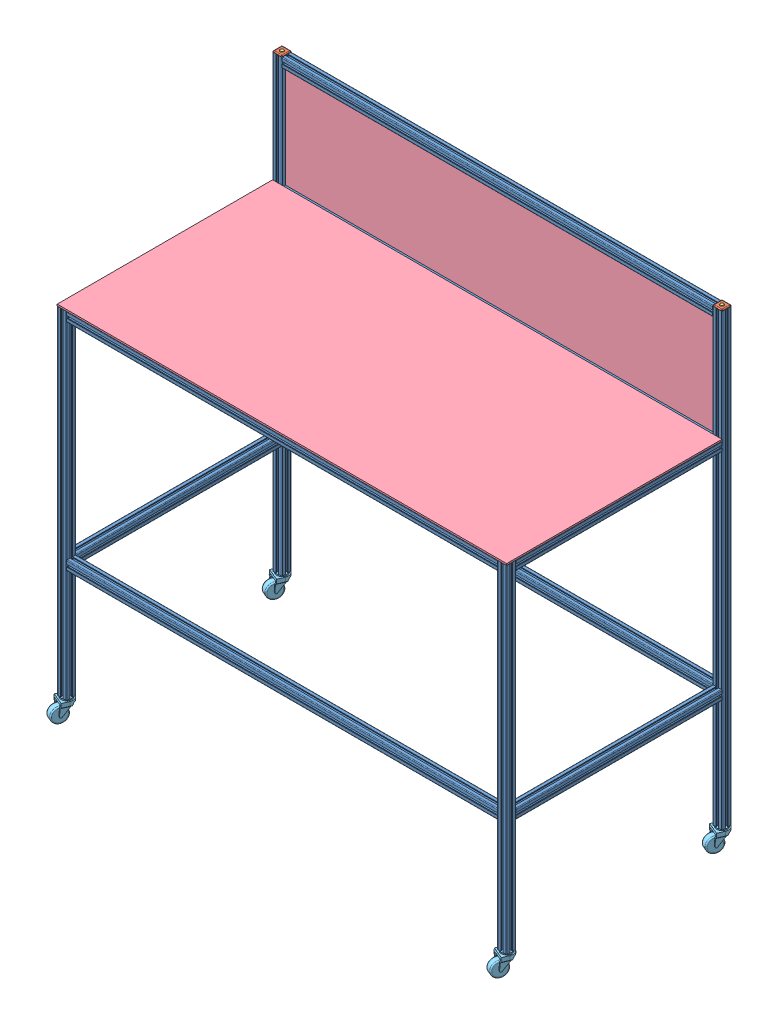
SolidWorks assembly 10-10 Work Bench (with casters).sldasm, configuration Default (file format 4700). Lengths in mm.
Overall size (1247.35 1280.62 648.87).
29 component instances, 5 part files, 62 mates.
Components (placement in the parent):
- 650000-1: 650000.sldprt [36] at (-1206.5 -918.8958 -12.7) x (1 0 0) z (0 -1 0) size (25.4 25.4 914.4)
- 650000-2: 650000.sldprt [46] at (-1193.8 -17.1958 -12.7) x (0 1 0) z (-1 0 0) size (25.4 25.4 1168.4)
- 650000-3: 650000.sldprt [36] at (-12.7 -4.4958 -12.7) x (-1 0 0) z (0 1 0) size (25.4 25.4 914.4)
- 650000-4: 650000.sldprt [22] at (-12.7 -17.1958 -25.4) x (0 1 0) z (0 0 1) size (25.4 25.4 558.8)
- 650000-5: 650000.sldprt [22] at (-1206.5 -17.1958 -25.4) x (0 1 0) z (0 0 1) size (25.4 25.4 558.8)
- 650000-9: 650000.sldprt [48] at (-12.7 -918.8958 -596.9) x (1 0 0) z (0 -1 0) size (25.4 25.4 1219.2)
- 650000-10: 650000.sldprt [48] at (-1206.5 -918.8958 -596.9) x (1 0 0) z (0 -1 0) size (25.4 25.4 1219.2)
- 650000-11: 650000.sldprt [46] at (-25.4 -17.1958 -596.9) x (0 1 0) z (1 0 0) size (25.4 25.4 1168.4)
- 650000-12: 650000.sldprt [46] at (-25.4 287.6042 -596.9) x (0 1 0) z (1 0 0) size (25.4 25.4 1168.4)
- 650000-13: 650000.sldprt [46] at (-1193.8 -601.3958 -12.7) x (0 -1 0) z (-1 0 0) size (25.4 25.4 1168.4)
- 650000-14: 650000.sldprt [22] at (-12.7 -601.3958 -584.2) x (1 0 0) z (0 0 -1) size (25.4 25.4 558.8)
- 650000-15: 650000.sldprt [46] at (-1193.8 -601.3958 -596.9) x (0 -1 0) z (-1 0 0) size (25.4 25.4 1168.4)
- 650000-16: 650000.sldprt [22] at (-1206.5 -601.3958 -25.4) size (25.4 25.4 558.8)
- 655000-1: 655000.sldasm [Default] at (-1206.5 300.3042 -596.9) x (0 0 -1) z (0 1 0) size (25.4 25.4 14.43)
  - TSLOT ENDCAPS-1: TSLOT ENDCAPS.SLDPRT [1010_655000] at origin size (25.4 25.4 5.46)
  - 651084-1: 651084.SLDPRT [Default] at (-0.0554 -0.0554 4.2672) x (-0.923728 -0.383049 0) z (0 0 -1) size (9.98 9.98 14.43)
- 655000-2: 655000.sldasm [Default] at (-12.7 300.3042 -596.9) x (0 0 -1) z (0 1 0) size (25.4 25.4 14.43)
  - TSLOT ENDCAPS-1: TSLOT ENDCAPS.SLDPRT [1010_655000] at origin size (25.4 25.4 5.46)
  - 651084-1: 651084.SLDPRT [Default] at (-0.0554 -0.0554 4.2672) x (-0.923728 -0.383049 0) z (0 0 -1) size (9.98 9.98 14.43)
- 655433-1: 655433.sldprt [23x48] at (0 0 -584.2) x (0 -1 0) z (0 0 -1) size (4.5 1219.2 584.2)
- 655433-2: 655433.sldprt [11.5x46.5] at (-19.05 -10.8458 -599.1479) x (0 0 1) z (0 -1 0) size (4.5 1181.1 292.1)
- 655231-1: 655231.sldasm [Default] at (-12.7 -918.8958 -12.7) x (-0.923728 0 -0.383049) z (0 1 0) size (34.95 55.51 95.25)
  - 655231-1: 655231.SLDPRT [Default] at origin size (34.95 55.51 95.25)
- 655231-2: 655231.sldasm [Default] at (-1206.5 -918.8958 -12.7) x (-0.923728 0 -0.383049) z (0 1 0) size (34.95 55.51 95.25)
  - 655231-1: 655231.SLDPRT [Default] at origin size (34.95 55.51 95.25)
- 655231-3: 655231.sldasm [Default] at (-12.7 -918.8958 -596.9) x (-0.923728 0 -0.383049) z (0 1 0) size (34.95 55.51 95.25)
  - 655231-1: 655231.SLDPRT [Default] at origin size (34.95 55.51 95.25)
- 655231-4: 655231.sldasm [Default] at (-1206.5 -918.8958 -596.9) x (-0.923728 0 -0.383049) z (0 1 0) size (34.95 55.51 95.25)
  - 655231-1: 655231.SLDPRT [Default] at origin size (34.95 55.51 95.25)
Mates (geometry in assembly coordinates):
- Coincident1: coincident anti-aligned: plane of 650000-1; plane of 650000-2 through (12.7 -17.1958 -12.7) normal (-1 0 0)
- Coincident3: coincident aligned: plane of 650000-1; plane of 650000-2
- Coincident5: coincident anti-aligned: plane of 650000-1; plane of 650000-2
- Coincident7: coincident anti-aligned: plane of 650000-2 through (1181.1 -17.1958 -12.7) normal (1 0 0); plane of 650000-3
- Coincident10: coincident anti-aligned: plane of 650000-2; plane of 650000-3 through (1193.8 -4.4958 -12.7) normal (0 0 1)
- Coincident11: coincident anti-aligned: plane of 650000-3; plane of 650000-4 through (1193.8 -17.1958 -25.4) normal (0 0 1)
- Coincident13: coincident aligned: plane of 650000-3 through (1193.8 -4.4958 -12.7) normal (0 1 0); plane of 650000-4
- Coincident15: coincident aligned: plane of 650000-3; plane of 650000-4
- Coincident16: coincident anti-aligned: plane of 650000-1 through (0 -918.8958 -25.4) normal (0 0 -1); plane of 650000-5 through (0 -17.1958 -25.4) normal (0 0 1)
- Coincident18: coincident aligned: plane of 650000-1; plane of 650000-5
- Coincident20: coincident anti-aligned: plane of 650000-1; plane of 650000-5
- Coincident36: coincident anti-aligned: plane of 650000-5 through (10.668 -27.8638 -584.2) normal (0 0 -1); plane of 650000-10 through (-3.2258 300.3042 -584.2) normal (0 0 1)
- Coincident37: coincident aligned: plane of 650000-5 through (12.7 -13.97 -584.2) normal (1 0 0); plane of 650000-10 through (12.7 300.3042 -593.6742) normal (1 0 0)
- Coincident39: coincident aligned: plane of 650000-4 through (1206.5 -13.97 -584.2) normal (1 0 0); plane of 650000-9 through (1206.5 300.3042 -593.6742) normal (1 0 0)
- Coincident40: coincident anti-aligned: plane of 650000-4 through (1204.468 -27.8638 -584.2) normal (0 0 -1); plane of 650000-9 through (1197.0258 300.3042 -584.2) normal (0 0 1)
- Coincident42: coincident anti-aligned: plane of 650000-9; plane of 650000-11 through (1181.1 -17.1958 -596.9) normal (1 0 0)
- Coincident43: coincident aligned: plane of 650000-9; plane of 650000-11
- Coincident44: coincident aligned: plane of 650000-4 through (1197.0258 -4.4958 -584.2) normal (0 1 0); plane of 650000-11 through (12.7 -4.4958 -593.6742) normal (0 1 0)
- Coincident45: coincident anti-aligned: plane of 650000-9; plane of 650000-12 through (1181.1 287.6042 -596.9) normal (1 0 0)
- Coincident46: coincident aligned: plane of 650000-9; plane of 650000-12
- Coincident47: coincident aligned: plane of 650000-10 through (-10.668 300.3042 -607.568) normal (0 1 0); plane of 650000-12 through (12.7 300.3042 -593.6742) normal (0 1 0)
- Coincident48: coincident anti-aligned: plane of 650000-1; plane of 650000-13 through (12.7 -601.3958 -12.7) normal (-1 0 0)
- Coincident49: coincident aligned: plane of 650000-1; plane of 650000-13
- Coincident50: coincident anti-aligned: plane of 650000-9; plane of 650000-14 through (1193.8 -601.3958 -584.2) normal (0 0 -1)
- Coincident51: coincident aligned: plane of 650000-9; plane of 650000-14
- Coincident52: coincident anti-aligned: plane of 650000-10; plane of 650000-15 through (12.7 -601.3958 -596.9) normal (-1 0 0)
- Coincident53: coincident aligned: plane of 650000-10; plane of 650000-15
- Coincident54: coincident anti-aligned: plane of 650000-1 through (0 -918.8958 -25.4) normal (0 0 -1); plane of 650000-16 through (0 -601.3958 -25.4) normal (0 0 1)
- Coincident55: coincident aligned: plane of 650000-1; plane of 650000-16 through (0 -601.3958 -25.4) normal (1 0 0)
- Distance3: distance = 304.8 mm aligned: plane of 650000-14 through (-9.4742 -614.0958 -25.4) normal (0 -1 0); plane of 650000-3 through (-2.032 -918.8958 -23.368) normal (0 -1 0)
- Distance4: distance = 304.8 mm aligned: plane of 650000-13 through (-25.4 -614.0958 -9.4742) normal (0 -1 0); plane of 650000-3 through (-2.032 -918.8958 -23.368) normal (0 -1 0)
- Distance5: distance = 304.8 mm aligned: plane of 650000-16 through (-1203.2742 -614.0958 -584.2) normal (0 -1 0); plane of 650000-10 through (-1217.168 -918.8958 -607.568) normal (0 -1 0)
- Distance6: distance = 304.8 mm aligned: plane of 650000-15 through (-25.4 -614.0958 -600.1258) normal (0 -1 0); plane of 650000-9 through (-23.368 -918.8958 -607.568) normal (0 -1 0)
- Coincident72: coincident anti-aligned: plane of 650000-10; plane of 655000-1
- Coincident73: coincident anti-aligned: plane of 650000-10; plane of 655000-1
- Coincident74: coincident anti-aligned: plane of 650000-10; plane of 655000-1
- Coincident75: coincident anti-aligned: plane of 650000-9; plane of 655000-2
- Coincident76: coincident anti-aligned: plane of 650000-9; plane of 655000-2
- Coincident77: coincident anti-aligned: plane of 650000-9; plane of 655000-2
- Coincident78: coincident anti-aligned: plane of 650000-5 through (3.2258 -4.4958 -584.2) normal (0 1 0); plane of 655433-1 through (-12.7 -4.4958 -584.2) normal (0 -1 0)
- Coincident79: coincident aligned: plane of 650000-4 through (1206.5 -13.97 -584.2) normal (1 0 0); plane of 655433-1 through (1206.5 -4.4958 -584.2) normal (1 0 0)
- Coincident80: coincident aligned: plane of 650000-2 through (1181.1 -13.97 0) normal (0 0 1); plane of 655433-1 through (1206.5 -4.4958 0) normal (0 0 1)
- Width1: width anti-aligned: plane of 655433-2 through (1187.45 -10.8458 -594.6521) normal (1 0 0); plane of 655433-2 through (6.35 -10.8458 -594.6521) normal (-1 0 0); plane of 650000-9 through (1181.1 300.3042 -600.1258) normal (-1 0 0); plane of 650000-10 through (12.7 300.3042 -600.1258) normal (1 0 0)
- Width2: width anti-aligned: plane of 655433-2 through (1187.45 281.2542 -594.6521) normal (0 1 0); plane of 655433-2 through (1187.45 -10.8458 -594.6521) normal (0 -1 0); plane of 650000-12 through (12.7 274.9042 -593.6742) normal (0 -1 0); plane of 650000-11 through (12.7 -4.4958 -593.6742) normal (0 1 0)
- Width3: width aligned: plane of 655433-2 through (6.35 -10.8458 -594.6521) normal (0 0 1); plane of 655433-2 through (6.35 -10.8458 -599.1479) normal (0 0 -1); plane of 650000-12 through (12.7 290.83 -584.2) normal (0 0 1); plane of 650000-12 through (12.7 290.83 -609.6) normal (0 0 -1)
- Coincident81: coincident aligned: plane of 650000-3 through (1204.468 -918.8958 -23.368) normal (0 -1 0); plane of 650000-9 through (1183.132 -918.8958 -607.568) normal (0 -1 0)
- Coincident82: coincident aligned: plane of 650000-1 through (-10.668 -918.8958 -23.368) normal (0 -1 0); plane of 650000-10 through (-10.668 -918.8958 -607.568) normal (0 -1 0)
- Coincident83: coincident anti-aligned: plane of 650000-3; plane of 655231-1 through (1193.8 -918.8958 -12.7) normal (0 1 0)
- Coincident84: coincident anti-aligned: plane of 650000-3; line of 655231-1 through (1193.8 -880.7958 -12.7) axis (0 -1 0)
- Coincident85: coincident anti-aligned: plane of 650000-3 through (1193.8 -4.4958 -12.7) normal (0 0 1); line of 655231-1 through (1193.8 -880.7958 -12.7) axis (0 -1 0)
- Coincident86: coincident anti-aligned: plane of 650000-1 through (0 -918.8958 -12.7) normal (0 -1 0); plane of 655231-2 through (0 -918.8958 -12.7) normal (0 1 0)
- Coincident87: coincident anti-aligned: plane of 650000-1; line of 655231-2 through (0 -880.7958 -12.7) axis (0 -1 0)
- Coincident88: coincident anti-aligned: plane of 650000-1; line of 655231-2 through (0 -880.7958 -12.7) axis (0 -1 0)
- Coincident89: coincident anti-aligned: plane of 650000-9 through (1193.8 -918.8958 -596.9) normal (0 -1 0); plane of 655231-3 through (1193.8 -918.8958 -596.9) normal (0 1 0)
- Coincident90: coincident anti-aligned: plane of 650000-9; line of 655231-3 through (1193.8 -880.7958 -596.9) axis (0 -1 0)
- Coincident91: coincident anti-aligned: plane of 650000-9; line of 655231-3 through (1193.8 -880.7958 -596.9) axis (0 -1 0)
- Coincident92: coincident anti-aligned: plane of 650000-10 through (0 -918.8958 -596.9) normal (0 -1 0); plane of 655231-4 through (0 -918.8958 -596.9) normal (0 1 0)
- Coincident93: coincident anti-aligned: plane of 650000-10; line of 655231-4 through (0 -880.7958 -596.9) axis (0 -1 0)
- Coincident94: coincident anti-aligned: plane of 650000-10; line of 655231-4 through (0 -880.7958 -596.9) axis (0 -1 0)
- Coincident95: coincident aligned: plane of 655433-1 through (-1219.2 0 -584.2) normal (0 1 0); plane of assembly
- Coincident96: coincident aligned: plane of 650000-2 through (-25.4 -13.97 0) normal (0 0 1); plane of assembly
- Coincident97: coincident aligned: plane of 650000-4 through (0 -20.4216 -584.2) normal (1 0 0); plane of assembly
